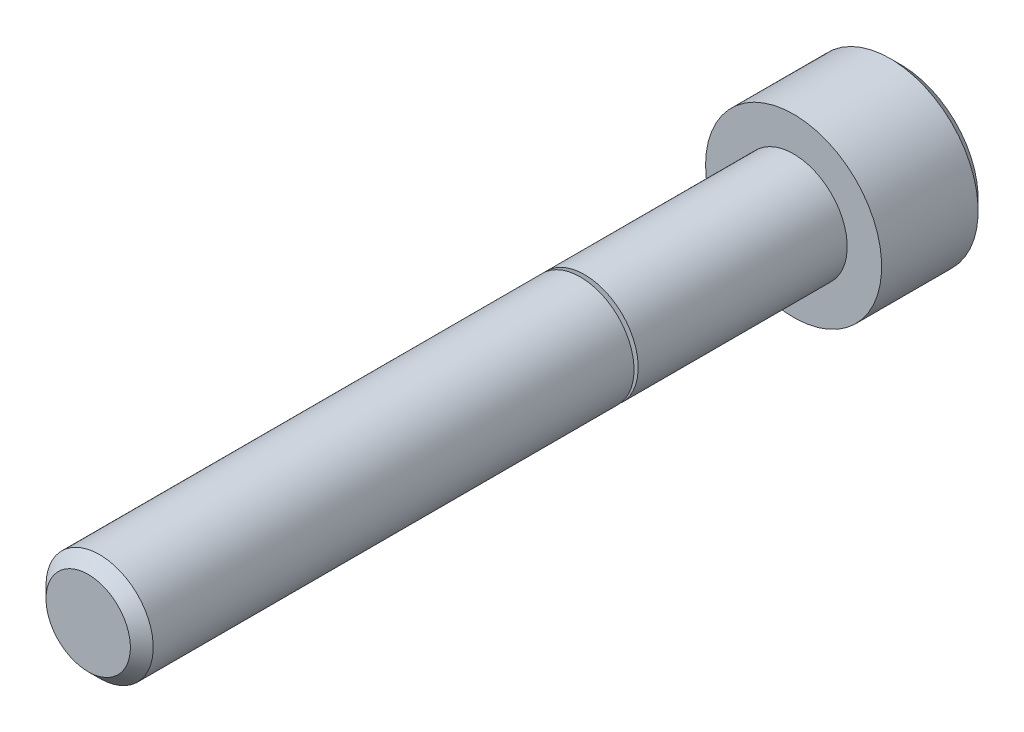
ISO-10303-21;
HEADER;
FILE_DESCRIPTION(('STEP AP214'),'2;1');
FILE_NAME('part.step','',(''),(''),'','','');
FILE_SCHEMA(('AUTOMOTIVE_DESIGN { 1 0 10303 214 1 1 1 1 }'));
ENDSEC;
DATA;
#1=APPLICATION_CONTEXT('core data for automotive mechanical design processes');
#2=APPLICATION_PROTOCOL_DEFINITION('international standard','automotive_design',2000,#1);
#3=PRODUCT_CONTEXT('',#1,'mechanical');
#4=PRODUCT('Part','Part','',(#3));
#5=PRODUCT_RELATED_PRODUCT_CATEGORY('part','',(#4));
#6=PRODUCT_DEFINITION_FORMATION('','',#4);
#7=PRODUCT_DEFINITION_CONTEXT('part definition',#1,'design');
#8=PRODUCT_DEFINITION('design','',#6,#7);
#9=PRODUCT_DEFINITION_SHAPE('','',#8);
#10=(LENGTH_UNIT() NAMED_UNIT(*) SI_UNIT(.MILLI.,.METRE.));
#11=(NAMED_UNIT(*) PLANE_ANGLE_UNIT() SI_UNIT($,.RADIAN.));
#12=(NAMED_UNIT(*) SI_UNIT($,.STERADIAN.) SOLID_ANGLE_UNIT());
#13=UNCERTAINTY_MEASURE_WITH_UNIT(LENGTH_MEASURE(1.E-05),#10,'distance_accuracy_value','');
#14=(GEOMETRIC_REPRESENTATION_CONTEXT(3) GLOBAL_UNCERTAINTY_ASSIGNED_CONTEXT((#13)) GLOBAL_UNIT_ASSIGNED_CONTEXT((#10,
#11,#12)) REPRESENTATION_CONTEXT('',''));
#15=CARTESIAN_POINT('',(0.,0.,0.));
#16=DIRECTION('',(0.,0.,1.));
#17=DIRECTION('',(1.,0.,0.));
#18=AXIS2_PLACEMENT_3D('',#15,#16,#17);
#19=CARTESIAN_POINT('',(0.,0.,-4.826));
#20=DIRECTION('',(0.,0.,1.));
#21=DIRECTION('',(1.,0.,0.));
#22=AXIS2_PLACEMENT_3D('',#19,#20,#21);
#23=PLANE('',#22);
#24=DIRECTION('',(-0.5,-0.866025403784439,0.));
#25=VECTOR('',#24,1.);
#26=CARTESIAN_POINT('',(2.29135888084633,0.,-4.826));
#27=LINE('',#26,#25);
#28=CARTESIAN_POINT('',(2.29135888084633,0.,-4.826));
#29=VERTEX_POINT('',#28);
#30=CARTESIAN_POINT('',(1.14567944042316,-1.984375,-4.826));
#31=VERTEX_POINT('',#30);
#32=EDGE_CURVE('E145',#29,#31,#27,.T.);
#33=ORIENTED_EDGE('',*,*,#32,.F.);
#34=DIRECTION('',(0.499999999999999,-0.866025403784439,0.));
#35=VECTOR('',#34,1.);
#36=CARTESIAN_POINT('',(1.14567944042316,1.984375,-4.826));
#37=LINE('',#36,#35);
#38=CARTESIAN_POINT('',(1.14567944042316,1.984375,-4.826));
#39=VERTEX_POINT('',#38);
#40=EDGE_CURVE('E64',#39,#29,#37,.T.);
#41=ORIENTED_EDGE('',*,*,#40,.F.);
#42=DIRECTION('',(1.,0.,0.));
#43=VECTOR('',#42,1.);
#44=CARTESIAN_POINT('',(-1.14567944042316,1.984375,-4.826));
#45=LINE('',#44,#43);
#46=CARTESIAN_POINT('',(-1.14567944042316,1.984375,-4.826));
#47=VERTEX_POINT('',#46);
#48=EDGE_CURVE('E158',#47,#39,#45,.T.);
#49=ORIENTED_EDGE('',*,*,#48,.F.);
#50=DIRECTION('',(0.5,0.866025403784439,0.));
#51=VECTOR('',#50,1.);
#52=CARTESIAN_POINT('',(-2.29135888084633,0.,-4.826));
#53=LINE('',#52,#51);
#54=CARTESIAN_POINT('',(-2.29135888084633,0.,-4.826));
#55=VERTEX_POINT('',#54);
#56=EDGE_CURVE('E155',#55,#47,#53,.T.);
#57=ORIENTED_EDGE('',*,*,#56,.F.);
#58=DIRECTION('',(-0.5,0.866025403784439,0.));
#59=VECTOR('',#58,1.);
#60=CARTESIAN_POINT('',(-1.14567944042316,-1.984375,-4.826));
#61=LINE('',#60,#59);
#62=CARTESIAN_POINT('',(-1.14567944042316,-1.984375,-4.826));
#63=VERTEX_POINT('',#62);
#64=EDGE_CURVE('E112',#63,#55,#61,.T.);
#65=ORIENTED_EDGE('',*,*,#64,.F.);
#66=DIRECTION('',(-1.,0.,0.));
#67=VECTOR('',#66,1.);
#68=CARTESIAN_POINT('',(1.14567944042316,-1.984375,-4.826));
#69=LINE('',#68,#67);
#70=EDGE_CURVE('E149',#31,#63,#69,.T.);
#71=ORIENTED_EDGE('',*,*,#70,.F.);
#72=EDGE_LOOP('',(#33,#41,#49,#57,#65,#71));
#73=FACE_BOUND('',#72,.T.);
#74=CARTESIAN_POINT('',(0.,0.,-4.826));
#75=DIRECTION('',(0.,0.,-1.));
#76=DIRECTION('',(-1.,0.,0.));
#77=AXIS2_PLACEMENT_3D('',#74,#75,#76);
#78=CIRCLE('',#77,3.4798);
#79=CARTESIAN_POINT('',(-3.4798,0.,-4.826));
#80=VERTEX_POINT('',#79);
#81=EDGE_CURVE('E164',#80,#80,#78,.T.);
#82=ORIENTED_EDGE('',*,*,#81,.T.);
#83=EDGE_LOOP('',(#82));
#84=FACE_BOUND('',#83,.T.);
#85=ADVANCED_FACE('F49',(#73,#84),#23,.F.);
#86=CARTESIAN_POINT('',(-1.89865000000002,0.,31.75));
#87=DIRECTION('',(0.,0.,-1.));
#88=DIRECTION('',(-1.,0.,0.));
#89=AXIS2_PLACEMENT_3D('',#86,#87,#88);
#90=PLANE('',#89);
#91=CARTESIAN_POINT('',(0.,0.,31.75));
#92=DIRECTION('',(0.,0.,-1.));
#93=DIRECTION('',(-1.,0.,0.));
#94=AXIS2_PLACEMENT_3D('',#91,#92,#93);
#95=CIRCLE('',#94,1.89865000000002);
#96=CARTESIAN_POINT('',(-1.89865000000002,0.,31.75));
#97=VERTEX_POINT('',#96);
#98=EDGE_CURVE('E11',#97,#97,#95,.T.);
#99=ORIENTED_EDGE('',*,*,#98,.F.);
#100=EDGE_LOOP('',(#99));
#101=FACE_BOUND('',#100,.T.);
#102=ADVANCED_FACE('F214',(#101),#90,.F.);
#103=CARTESIAN_POINT('',(0.,0.,31.75));
#104=DIRECTION('',(0.,0.,-1.));
#105=DIRECTION('',(-1.,0.,0.));
#106=AXIS2_PLACEMENT_3D('',#103,#104,#105);
#107=CONICAL_SURFACE('',#106,1.89865000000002,0.785398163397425);
#108=CARTESIAN_POINT('',(0.,0.,31.23565));
#109=DIRECTION('',(0.,0.,-1.));
#110=DIRECTION('',(-1.,0.,0.));
#111=AXIS2_PLACEMENT_3D('',#108,#109,#110);
#112=CIRCLE('',#111,2.41300000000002);
#113=CARTESIAN_POINT('',(-2.41300000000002,0.,31.23565));
#114=VERTEX_POINT('',#113);
#115=EDGE_CURVE('E57',#114,#114,#112,.T.);
#116=ORIENTED_EDGE('',*,*,#115,.F.);
#117=EDGE_LOOP('',(#116));
#118=FACE_BOUND('',#117,.T.);
#119=ORIENTED_EDGE('',*,*,#98,.T.);
#120=EDGE_LOOP('',(#119));
#121=FACE_BOUND('',#120,.T.);
#122=ADVANCED_FACE('F211',(#118,#121),#107,.T.);
#123=CARTESIAN_POINT('',(0.,0.,-10.585154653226));
#124=DIRECTION('',(0.,0.,-1.));
#125=DIRECTION('',(-1.,0.,0.));
#126=AXIS2_PLACEMENT_3D('',#123,#124,#125);
#127=CYLINDRICAL_SURFACE('',#126,2.41300000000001);
#128=CARTESIAN_POINT('',(0.,0.,9.59520808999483));
#129=DIRECTION('',(0.,0.,-1.));
#130=DIRECTION('',(-1.,0.,0.));
#131=AXIS2_PLACEMENT_3D('',#128,#129,#130);
#132=CIRCLE('',#131,2.41300000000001);
#133=CARTESIAN_POINT('',(-2.41300000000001,0.,9.59520808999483));
#134=VERTEX_POINT('',#133);
#135=EDGE_CURVE('E201',#134,#134,#132,.T.);
#136=ORIENTED_EDGE('',*,*,#135,.F.);
#137=EDGE_LOOP('',(#136));
#138=FACE_BOUND('',#137,.T.);
#139=ORIENTED_EDGE('',*,*,#115,.T.);
#140=EDGE_LOOP('',(#139));
#141=FACE_BOUND('',#140,.T.);
#142=ADVANCED_FACE('F209',(#138,#141),#127,.T.);
#143=CARTESIAN_POINT('',(0.,0.,9.59520808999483));
#144=DIRECTION('',(0.,0.,1.));
#145=DIRECTION('',(1.,0.,0.));
#146=AXIS2_PLACEMENT_3D('',#143,#144,#145);
#147=CONICAL_SURFACE('',#146,2.41300000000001,1.22173047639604);
#148=CARTESIAN_POINT('',(0.,0.,9.44679385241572));
#149=DIRECTION('',(0.,0.,-1.));
#150=DIRECTION('',(-1.,0.,0.));
#151=AXIS2_PLACEMENT_3D('',#148,#149,#150);
#152=CIRCLE('',#151,2.00523523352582);
#153=CARTESIAN_POINT('',(-2.00523523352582,0.,9.44679385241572));
#154=VERTEX_POINT('',#153);
#155=EDGE_CURVE('E197',#154,#154,#152,.T.);
#156=ORIENTED_EDGE('',*,*,#155,.F.);
#157=EDGE_LOOP('',(#156));
#158=FACE_BOUND('',#157,.T.);
#159=ORIENTED_EDGE('',*,*,#135,.T.);
#160=EDGE_LOOP('',(#159));
#161=FACE_BOUND('',#160,.T.);
#162=ADVANCED_FACE('F226',(#158,#161),#147,.T.);
#163=CARTESIAN_POINT('',(0.,0.,9.428));
#164=DIRECTION('',(0.,0.,-1.));
#165=DIRECTION('',(-1.,0.,0.));
#166=AXIS2_PLACEMENT_3D('',#163,#164,#165);
#167=TOROIDAL_SURFACE('',#166,2.01207563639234,0.0199999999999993);
#168=CARTESIAN_POINT('',(0.,0.,9.408));
#169=DIRECTION('',(0.,0.,-1.));
#170=DIRECTION('',(-1.,0.,0.));
#171=AXIS2_PLACEMENT_3D('',#168,#169,#170);
#172=CIRCLE('',#171,2.01207563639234);
#173=CARTESIAN_POINT('',(-2.01207563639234,0.,9.408));
#174=VERTEX_POINT('',#173);
#175=EDGE_CURVE('E193',#174,#174,#172,.T.);
#176=ORIENTED_EDGE('',*,*,#175,.F.);
#177=EDGE_LOOP('',(#176));
#178=FACE_BOUND('',#177,.T.);
#179=ORIENTED_EDGE('',*,*,#155,.T.);
#180=EDGE_LOOP('',(#179));
#181=FACE_BOUND('',#180,.T.);
#182=ADVANCED_FACE('F230',(#178,#181),#167,.F.);
#183=CARTESIAN_POINT('',(-2.41300000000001,0.,9.408));
#184=DIRECTION('',(0.,0.,-1.));
#185=DIRECTION('',(-1.,0.,0.));
#186=AXIS2_PLACEMENT_3D('',#183,#184,#185);
#187=PLANE('',#186);
#188=CARTESIAN_POINT('',(0.,0.,9.40799999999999));
#189=DIRECTION('',(0.,0.,-1.));
#190=DIRECTION('',(-1.,0.,0.));
#191=AXIS2_PLACEMENT_3D('',#188,#189,#190);
#192=CIRCLE('',#191,2.41300000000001);
#193=CARTESIAN_POINT('',(-2.41300000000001,0.,9.40799999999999));
#194=VERTEX_POINT('',#193);
#195=EDGE_CURVE('E189',#194,#194,#192,.T.);
#196=ORIENTED_EDGE('',*,*,#195,.F.);
#197=EDGE_LOOP('',(#196));
#198=FACE_BOUND('',#197,.T.);
#199=ORIENTED_EDGE('',*,*,#175,.T.);
#200=EDGE_LOOP('',(#199));
#201=FACE_BOUND('',#200,.T.);
#202=ADVANCED_FACE('F234',(#198,#201),#187,.F.);
#203=CARTESIAN_POINT('',(0.,0.,-10.585154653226));
#204=DIRECTION('',(0.,0.,-1.));
#205=DIRECTION('',(-1.,0.,0.));
#206=AXIS2_PLACEMENT_3D('',#203,#204,#205);
#207=CYLINDRICAL_SURFACE('',#206,2.413);
#208=CARTESIAN_POINT('',(0.,0.,0.));
#209=DIRECTION('',(0.,0.,-1.));
#210=DIRECTION('',(-1.,0.,0.));
#211=AXIS2_PLACEMENT_3D('',#208,#209,#210);
#212=CIRCLE('',#211,2.413);
#213=CARTESIAN_POINT('',(-2.413,0.,0.));
#214=VERTEX_POINT('',#213);
#215=EDGE_CURVE('E185',#214,#214,#212,.T.);
#216=ORIENTED_EDGE('',*,*,#215,.F.);
#217=EDGE_LOOP('',(#216));
#218=FACE_BOUND('',#217,.T.);
#219=ORIENTED_EDGE('',*,*,#195,.T.);
#220=EDGE_LOOP('',(#219));
#221=FACE_BOUND('',#220,.T.);
#222=ADVANCED_FACE('F238',(#218,#221),#207,.T.);
#223=CARTESIAN_POINT('',(-3.96240000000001,0.,0.));
#224=DIRECTION('',(0.,0.,-1.));
#225=DIRECTION('',(-1.,0.,0.));
#226=AXIS2_PLACEMENT_3D('',#223,#224,#225);
#227=PLANE('',#226);
#228=CARTESIAN_POINT('',(0.,0.,0.));
#229=DIRECTION('',(0.,0.,-1.));
#230=DIRECTION('',(-1.,0.,0.));
#231=AXIS2_PLACEMENT_3D('',#228,#229,#230);
#232=CIRCLE('',#231,3.96240000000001);
#233=CARTESIAN_POINT('',(-3.96240000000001,0.,0.));
#234=VERTEX_POINT('',#233);
#235=EDGE_CURVE('E181',#234,#234,#232,.T.);
#236=ORIENTED_EDGE('',*,*,#235,.F.);
#237=EDGE_LOOP('',(#236));
#238=FACE_BOUND('',#237,.T.);
#239=ORIENTED_EDGE('',*,*,#215,.T.);
#240=EDGE_LOOP('',(#239));
#241=FACE_BOUND('',#240,.T.);
#242=ADVANCED_FACE('F242',(#238,#241),#227,.F.);
#243=CARTESIAN_POINT('',(0.,0.,-10.585154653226));
#244=DIRECTION('',(0.,0.,-1.));
#245=DIRECTION('',(-1.,0.,0.));
#246=AXIS2_PLACEMENT_3D('',#243,#244,#245);
#247=CYLINDRICAL_SURFACE('',#246,3.9624);
#248=CARTESIAN_POINT('',(0.,0.,-4.3434));
#249=DIRECTION('',(0.,0.,-1.));
#250=DIRECTION('',(-1.,0.,0.));
#251=AXIS2_PLACEMENT_3D('',#248,#249,#250);
#252=CIRCLE('',#251,3.9624);
#253=CARTESIAN_POINT('',(-3.9624,0.,-4.3434));
#254=VERTEX_POINT('',#253);
#255=EDGE_CURVE('E177',#254,#254,#252,.T.);
#256=ORIENTED_EDGE('',*,*,#255,.F.);
#257=EDGE_LOOP('',(#256));
#258=FACE_BOUND('',#257,.T.);
#259=ORIENTED_EDGE('',*,*,#235,.T.);
#260=EDGE_LOOP('',(#259));
#261=FACE_BOUND('',#260,.T.);
#262=ADVANCED_FACE('F246',(#258,#261),#247,.T.);
#263=CARTESIAN_POINT('',(0.,0.,-4.3434));
#264=DIRECTION('',(0.,0.,1.));
#265=DIRECTION('',(1.,0.,0.));
#266=AXIS2_PLACEMENT_3D('',#263,#264,#265);
#267=CONICAL_SURFACE('',#266,3.9624,0.785398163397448);
#268=ORIENTED_EDGE('',*,*,#81,.F.);
#269=EDGE_LOOP('',(#268));
#270=FACE_BOUND('',#269,.T.);
#271=ORIENTED_EDGE('',*,*,#255,.T.);
#272=EDGE_LOOP('',(#271));
#273=FACE_BOUND('',#272,.T.);
#274=ADVANCED_FACE('F250',(#270,#273),#267,.T.);
#275=CARTESIAN_POINT('',(1.14567944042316,1.984375,-2.413));
#276=DIRECTION('',(0.866025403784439,0.499999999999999,0.));
#277=DIRECTION('',(-0.499999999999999,0.866025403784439,0.));
#278=AXIS2_PLACEMENT_3D('',#275,#276,#277);
#279=PLANE('',#278);
#280=ORIENTED_EDGE('',*,*,#40,.T.);
#281=DIRECTION('',(0.,0.,-1.));
#282=VECTOR('',#281,1.);
#283=CARTESIAN_POINT('',(2.29135888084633,0.,-2.413));
#284=LINE('',#283,#282);
#285=CARTESIAN_POINT('',(2.29135888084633,0.,-2.413));
#286=VERTEX_POINT('',#285);
#287=EDGE_CURVE('E94',#286,#29,#284,.T.);
#288=ORIENTED_EDGE('',*,*,#287,.F.);
#289=DIRECTION('',(0.499999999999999,-0.866025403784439,0.));
#290=VECTOR('',#289,1.);
#291=CARTESIAN_POINT('',(1.14567944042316,1.984375,-2.413));
#292=LINE('',#291,#290);
#293=CARTESIAN_POINT('',(1.14567944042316,1.984375,-2.413));
#294=VERTEX_POINT('',#293);
#295=EDGE_CURVE('E161',#294,#286,#292,.T.);
#296=ORIENTED_EDGE('',*,*,#295,.F.);
#297=DIRECTION('',(0.,0.,-1.));
#298=VECTOR('',#297,1.);
#299=CARTESIAN_POINT('',(1.14567944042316,1.984375,-2.413));
#300=LINE('',#299,#298);
#301=EDGE_CURVE('E72',#294,#39,#300,.T.);
#302=ORIENTED_EDGE('',*,*,#301,.T.);
#303=EDGE_LOOP('',(#280,#288,#296,#302));
#304=FACE_BOUND('',#303,.T.);
#305=ADVANCED_FACE('F254',(#304),#279,.F.);
#306=CARTESIAN_POINT('',(-1.14567944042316,1.984375,-2.413));
#307=DIRECTION('',(0.,1.,0.));
#308=DIRECTION('',(-1.,0.,0.));
#309=AXIS2_PLACEMENT_3D('',#306,#307,#308);
#310=PLANE('',#309);
#311=ORIENTED_EDGE('',*,*,#48,.T.);
#312=ORIENTED_EDGE('',*,*,#301,.F.);
#313=DIRECTION('',(1.,0.,0.));
#314=VECTOR('',#313,1.);
#315=CARTESIAN_POINT('',(-1.14567944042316,1.984375,-2.413));
#316=LINE('',#315,#314);
#317=CARTESIAN_POINT('',(-1.14567944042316,1.984375,-2.413));
#318=VERTEX_POINT('',#317);
#319=EDGE_CURVE('E126',#318,#294,#316,.T.);
#320=ORIENTED_EDGE('',*,*,#319,.F.);
#321=DIRECTION('',(0.,0.,-1.));
#322=VECTOR('',#321,1.);
#323=CARTESIAN_POINT('',(-1.14567944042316,1.984375,-2.413));
#324=LINE('',#323,#322);
#325=EDGE_CURVE('E117',#318,#47,#324,.T.);
#326=ORIENTED_EDGE('',*,*,#325,.T.);
#327=EDGE_LOOP('',(#311,#312,#320,#326));
#328=FACE_BOUND('',#327,.T.);
#329=ADVANCED_FACE('F258',(#328),#310,.F.);
#330=CARTESIAN_POINT('',(-2.29135888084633,0.,-2.413));
#331=DIRECTION('',(-0.866025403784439,0.5,0.));
#332=DIRECTION('',(-0.5,-0.866025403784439,0.));
#333=AXIS2_PLACEMENT_3D('',#330,#331,#332);
#334=PLANE('',#333);
#335=ORIENTED_EDGE('',*,*,#56,.T.);
#336=ORIENTED_EDGE('',*,*,#325,.F.);
#337=DIRECTION('',(0.5,0.866025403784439,0.));
#338=VECTOR('',#337,1.);
#339=CARTESIAN_POINT('',(-2.29135888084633,0.,-2.413));
#340=LINE('',#339,#338);
#341=CARTESIAN_POINT('',(-2.29135888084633,0.,-2.413));
#342=VERTEX_POINT('',#341);
#343=EDGE_CURVE('E121',#342,#318,#340,.T.);
#344=ORIENTED_EDGE('',*,*,#343,.F.);
#345=DIRECTION('',(0.,0.,-1.));
#346=VECTOR('',#345,1.);
#347=CARTESIAN_POINT('',(-2.29135888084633,0.,-2.413));
#348=LINE('',#347,#346);
#349=EDGE_CURVE('E105',#342,#55,#348,.T.);
#350=ORIENTED_EDGE('',*,*,#349,.T.);
#351=EDGE_LOOP('',(#335,#336,#344,#350));
#352=FACE_BOUND('',#351,.T.);
#353=ADVANCED_FACE('F122',(#352),#334,.F.);
#354=CARTESIAN_POINT('',(-1.14567944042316,-1.984375,-2.413));
#355=DIRECTION('',(-0.866025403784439,-0.5,0.));
#356=DIRECTION('',(0.5,-0.866025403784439,0.));
#357=AXIS2_PLACEMENT_3D('',#354,#355,#356);
#358=PLANE('',#357);
#359=ORIENTED_EDGE('',*,*,#64,.T.);
#360=ORIENTED_EDGE('',*,*,#349,.F.);
#361=DIRECTION('',(-0.5,0.866025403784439,0.));
#362=VECTOR('',#361,1.);
#363=CARTESIAN_POINT('',(-1.14567944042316,-1.984375,-2.413));
#364=LINE('',#363,#362);
#365=CARTESIAN_POINT('',(-1.14567944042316,-1.984375,-2.413));
#366=VERTEX_POINT('',#365);
#367=EDGE_CURVE('E109',#366,#342,#364,.T.);
#368=ORIENTED_EDGE('',*,*,#367,.F.);
#369=DIRECTION('',(0.,0.,-1.));
#370=VECTOR('',#369,1.);
#371=CARTESIAN_POINT('',(-1.14567944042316,-1.984375,-2.413));
#372=LINE('',#371,#370);
#373=EDGE_CURVE('E118',#366,#63,#372,.T.);
#374=ORIENTED_EDGE('',*,*,#373,.T.);
#375=EDGE_LOOP('',(#359,#360,#368,#374));
#376=FACE_BOUND('',#375,.T.);
#377=ADVANCED_FACE('F107',(#376),#358,.F.);
#378=CARTESIAN_POINT('',(1.14567944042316,-1.984375,-2.413));
#379=DIRECTION('',(0.,-1.,0.));
#380=DIRECTION('',(1.,0.,0.));
#381=AXIS2_PLACEMENT_3D('',#378,#379,#380);
#382=PLANE('',#381);
#383=ORIENTED_EDGE('',*,*,#70,.T.);
#384=ORIENTED_EDGE('',*,*,#373,.F.);
#385=DIRECTION('',(-1.,0.,0.));
#386=VECTOR('',#385,1.);
#387=CARTESIAN_POINT('',(1.14567944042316,-1.984375,-2.413));
#388=LINE('',#387,#386);
#389=CARTESIAN_POINT('',(1.14567944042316,-1.984375,-2.413));
#390=VERTEX_POINT('',#389);
#391=EDGE_CURVE('E132',#390,#366,#388,.T.);
#392=ORIENTED_EDGE('',*,*,#391,.F.);
#393=DIRECTION('',(0.,0.,-1.));
#394=VECTOR('',#393,1.);
#395=CARTESIAN_POINT('',(1.14567944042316,-1.984375,-2.413));
#396=LINE('',#395,#394);
#397=EDGE_CURVE('E169',#390,#31,#396,.T.);
#398=ORIENTED_EDGE('',*,*,#397,.T.);
#399=EDGE_LOOP('',(#383,#384,#392,#398));
#400=FACE_BOUND('',#399,.T.);
#401=ADVANCED_FACE('F262',(#400),#382,.F.);
#402=CARTESIAN_POINT('',(2.29135888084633,0.,-2.413));
#403=DIRECTION('',(0.866025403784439,-0.5,0.));
#404=DIRECTION('',(0.5,0.866025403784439,0.));
#405=AXIS2_PLACEMENT_3D('',#402,#403,#404);
#406=PLANE('',#405);
#407=ORIENTED_EDGE('',*,*,#32,.T.);
#408=ORIENTED_EDGE('',*,*,#397,.F.);
#409=DIRECTION('',(-0.5,-0.866025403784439,0.));
#410=VECTOR('',#409,1.);
#411=CARTESIAN_POINT('',(2.29135888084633,0.,-2.413));
#412=LINE('',#411,#410);
#413=EDGE_CURVE('E137',#286,#390,#412,.T.);
#414=ORIENTED_EDGE('',*,*,#413,.F.);
#415=ORIENTED_EDGE('',*,*,#287,.T.);
#416=EDGE_LOOP('',(#407,#408,#414,#415));
#417=FACE_BOUND('',#416,.T.);
#418=ADVANCED_FACE('F259',(#417),#406,.F.);
#419=CARTESIAN_POINT('',(3.43703832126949,-1.984375,-2.413));
#420=DIRECTION('',(0.,0.,-1.));
#421=DIRECTION('',(-1.,0.,0.));
#422=AXIS2_PLACEMENT_3D('',#419,#420,#421);
#423=PLANE('',#422);
#424=ORIENTED_EDGE('',*,*,#295,.T.);
#425=ORIENTED_EDGE('',*,*,#413,.T.);
#426=ORIENTED_EDGE('',*,*,#391,.T.);
#427=ORIENTED_EDGE('',*,*,#367,.T.);
#428=ORIENTED_EDGE('',*,*,#343,.T.);
#429=ORIENTED_EDGE('',*,*,#319,.T.);
#430=EDGE_LOOP('',(#424,#425,#426,#427,#428,#429));
#431=FACE_BOUND('',#430,.T.);
#432=ADVANCED_FACE('F129',(#431),#423,.T.);
#433=CLOSED_SHELL('',(#85,#102,#122,#142,#162,#182,#202,#222,#242,#262,#274,#305,#329,#353,#377,
#401,#418,#432));
#434=MANIFOLD_SOLID_BREP('B2',#433);
#435=ADVANCED_BREP_SHAPE_REPRESENTATION('',(#18,#434),#14);
#436=SHAPE_DEFINITION_REPRESENTATION(#9,#435);
ENDSEC;
END-ISO-10303-21;
